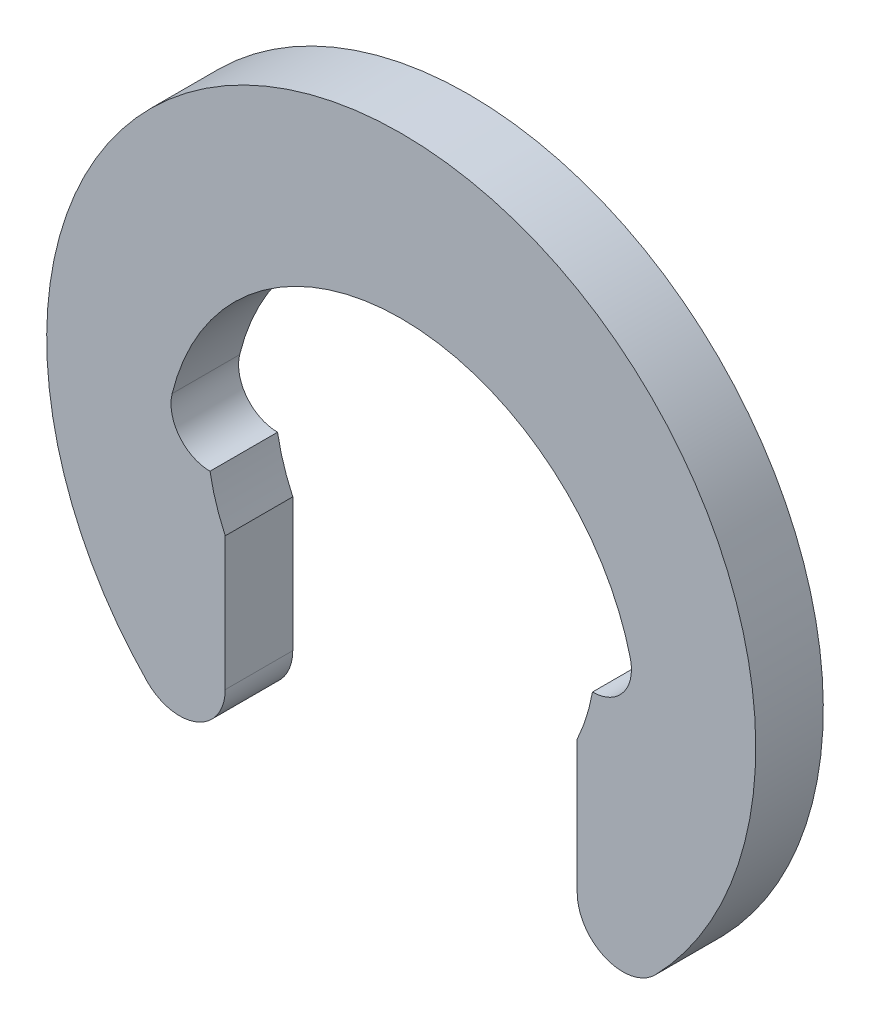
from build123d import *

# Parameters (mm, degrees)
BODY_DEPTH = 0.4


with BuildPart() as part:
    # BodySke → Body (new body)
    with BuildSketch(Plane.XY):
        with BuildLine():
            Line((1.042253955, -0.486011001), (1.042253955, -1.274837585))
            ThreePointArc((1.042253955, -1.274837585), (1.210735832, -1.525025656), (1.505913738, -1.462975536))
            ThreePointArc((1.505913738, -1.462975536), (0, 2.099541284), (-1.505913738, -1.462975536))
            ThreePointArc((-1.505913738, -1.462975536), (-1.210735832, -1.525025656), (-1.042253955, -1.274837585))
            Line((-1.042253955, -1.274837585), (-1.042253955, -0.486011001))
            ThreePointArc((-1.042253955, -0.486011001), (-1.096774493, -0.345811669), (-1.132528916, -0.199695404))
            ThreePointArc((-1.132528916, -0.199695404), (-1.314172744, -0.111299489), (-1.356694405, 0.08618526))
            ThreePointArc((-1.356694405, 0.08618526), (0, 1.15), (1.356694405, 0.08618526))
            ThreePointArc((1.356694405, 0.08618526), (1.314172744, -0.111299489), (1.132528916, -0.199695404))
            ThreePointArc((1.132528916, -0.199695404), (1.096774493, -0.345811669), (1.042253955, -0.486011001))
        make_face()
    extrude(amount=-BODY_DEPTH)


solid = part.part
